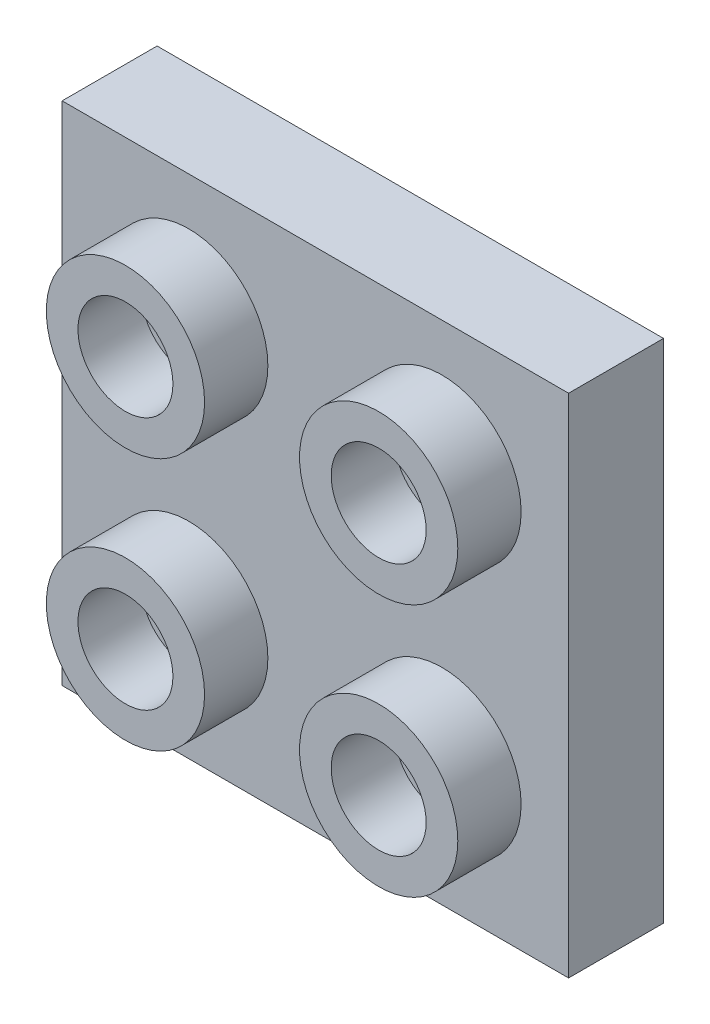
ISO-10303-21;
HEADER;
FILE_DESCRIPTION(('STEP AP214'),'2;1');
FILE_NAME('part.step','',(''),(''),'','','');
FILE_SCHEMA(('AUTOMOTIVE_DESIGN { 1 0 10303 214 1 1 1 1 }'));
ENDSEC;
DATA;
#1=APPLICATION_CONTEXT('core data for automotive mechanical design processes');
#2=APPLICATION_PROTOCOL_DEFINITION('international standard','automotive_design',2000,#1);
#3=PRODUCT_CONTEXT('',#1,'mechanical');
#4=PRODUCT('Part','Part','',(#3));
#5=PRODUCT_RELATED_PRODUCT_CATEGORY('part','',(#4));
#6=PRODUCT_DEFINITION_FORMATION('','',#4);
#7=PRODUCT_DEFINITION_CONTEXT('part definition',#1,'design');
#8=PRODUCT_DEFINITION('design','',#6,#7);
#9=PRODUCT_DEFINITION_SHAPE('','',#8);
#10=(LENGTH_UNIT() NAMED_UNIT(*) SI_UNIT(.MILLI.,.METRE.));
#11=(NAMED_UNIT(*) PLANE_ANGLE_UNIT() SI_UNIT($,.RADIAN.));
#12=(NAMED_UNIT(*) SI_UNIT($,.STERADIAN.) SOLID_ANGLE_UNIT());
#13=UNCERTAINTY_MEASURE_WITH_UNIT(LENGTH_MEASURE(1.E-05),#10,'distance_accuracy_value','');
#14=(GEOMETRIC_REPRESENTATION_CONTEXT(3) GLOBAL_UNCERTAINTY_ASSIGNED_CONTEXT((#13)) GLOBAL_UNIT_ASSIGNED_CONTEXT((#10,
#11,#12)) REPRESENTATION_CONTEXT('',''));
#15=CARTESIAN_POINT('',(0.,0.,0.));
#16=DIRECTION('',(0.,0.,1.));
#17=DIRECTION('',(1.,0.,0.));
#18=AXIS2_PLACEMENT_3D('',#15,#16,#17);
#19=CARTESIAN_POINT('',(-0.577603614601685,-1.13171549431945,-3.5));
#20=DIRECTION('',(0.,-1.,0.));
#21=DIRECTION('',(0.,0.,-1.));
#22=AXIS2_PLACEMENT_3D('',#19,#20,#21);
#23=CYLINDRICAL_SURFACE('',#22,2.45);
#24=CARTESIAN_POINT('',(-0.577603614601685,-1.13171549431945,-3.5));
#25=DIRECTION('',(0.,-1.,0.));
#26=DIRECTION('',(0.,0.,-1.));
#27=AXIS2_PLACEMENT_3D('',#24,#25,#26);
#28=CIRCLE('',#27,2.45);
#29=CARTESIAN_POINT('',(-0.577603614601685,-1.13171549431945,-5.95));
#30=VERTEX_POINT('',#29);
#31=EDGE_CURVE('E162',#30,#30,#28,.T.);
#32=ORIENTED_EDGE('',*,*,#31,.F.);
#33=EDGE_LOOP('',(#32));
#34=FACE_BOUND('',#33,.T.);
#35=CARTESIAN_POINT('',(-0.577603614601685,-7.33171549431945,-3.5));
#36=DIRECTION('',(0.,-1.,0.));
#37=DIRECTION('',(0.,0.,-1.));
#38=AXIS2_PLACEMENT_3D('',#35,#36,#37);
#39=CIRCLE('',#38,2.45);
#40=CARTESIAN_POINT('',(-0.577603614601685,-7.33171549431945,-5.95));
#41=VERTEX_POINT('',#40);
#42=EDGE_CURVE('E39',#41,#41,#39,.F.);
#43=ORIENTED_EDGE('',*,*,#42,.F.);
#44=EDGE_LOOP('',(#43));
#45=FACE_BOUND('',#44,.T.);
#46=ADVANCED_FACE('F35',(#34,#45),#23,.F.);
#47=CARTESIAN_POINT('',(-7.07760361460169,-6.63171549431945,-1.));
#48=DIRECTION('',(0.,-1.,0.));
#49=DIRECTION('',(1.,0.,0.));
#50=AXIS2_PLACEMENT_3D('',#47,#48,#49);
#51=PLANE('',#50);
#52=DIRECTION('',(-1.,0.,0.));
#53=VECTOR('',#52,1.);
#54=CARTESIAN_POINT('',(-7.07760361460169,-6.63171549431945,-1.));
#55=LINE('',#54,#53);
#56=CARTESIAN_POINT('',(-4.57760361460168,-6.63171549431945,-1.));
#57=VERTEX_POINT('',#56);
#58=CARTESIAN_POINT('',(-7.07760361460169,-6.63171549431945,-1.));
#59=VERTEX_POINT('',#58);
#60=EDGE_CURVE('E192',#57,#59,#55,.T.);
#61=ORIENTED_EDGE('',*,*,#60,.F.);
#62=DIRECTION('',(0.,0.,-1.));
#63=VECTOR('',#62,1.);
#64=CARTESIAN_POINT('',(-4.57760361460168,-6.63171549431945,-1.));
#65=LINE('',#64,#63);
#66=CARTESIAN_POINT('',(-4.57760361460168,-6.63171549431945,-3.));
#67=VERTEX_POINT('',#66);
#68=EDGE_CURVE('E176',#57,#67,#65,.T.);
#69=ORIENTED_EDGE('',*,*,#68,.T.);
#70=DIRECTION('',(-1.,0.,0.));
#71=VECTOR('',#70,1.);
#72=CARTESIAN_POINT('',(-7.07760361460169,-6.63171549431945,-3.));
#73=LINE('',#72,#71);
#74=CARTESIAN_POINT('',(-7.07760361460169,-6.63171549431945,-3.));
#75=VERTEX_POINT('',#74);
#76=EDGE_CURVE('E204',#67,#75,#73,.T.);
#77=ORIENTED_EDGE('',*,*,#76,.T.);
#78=DIRECTION('',(0.,0.,-1.));
#79=VECTOR('',#78,1.);
#80=CARTESIAN_POINT('',(-7.07760361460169,-6.63171549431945,-1.));
#81=LINE('',#80,#79);
#82=EDGE_CURVE('E207',#59,#75,#81,.T.);
#83=ORIENTED_EDGE('',*,*,#82,.F.);
#84=EDGE_LOOP('',(#61,#69,#77,#83));
#85=FACE_BOUND('',#84,.T.);
#86=ADVANCED_FACE('F299',(#85),#51,.F.);
#87=CARTESIAN_POINT('',(-8.57760361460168,-8.13171549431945,0.));
#88=DIRECTION('',(0.,0.,1.));
#89=DIRECTION('',(1.,0.,0.));
#90=AXIS2_PLACEMENT_3D('',#87,#88,#89);
#91=PLANE('',#90);
#92=CARTESIAN_POINT('',(-4.57760361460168,-4.13171549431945,0.));
#93=DIRECTION('',(0.,0.,1.));
#94=DIRECTION('',(1.,0.,0.));
#95=AXIS2_PLACEMENT_3D('',#92,#93,#94);
#96=CIRCLE('',#95,2.5);
#97=CARTESIAN_POINT('',(-2.07760361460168,-4.13171549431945,0.));
#98=VERTEX_POINT('',#97);
#99=EDGE_CURVE('E220',#98,#98,#96,.T.);
#100=ORIENTED_EDGE('',*,*,#99,.F.);
#101=EDGE_LOOP('',(#100));
#102=FACE_BOUND('',#101,.T.);
#103=DIRECTION('',(1.,0.,0.));
#104=VECTOR('',#103,1.);
#105=CARTESIAN_POINT('',(-8.57760361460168,-8.13171549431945,0.));
#106=LINE('',#105,#104);
#107=CARTESIAN_POINT('',(-8.57760361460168,-8.13171549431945,0.));
#108=VERTEX_POINT('',#107);
#109=CARTESIAN_POINT('',(7.42239638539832,-8.13171549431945,0.));
#110=VERTEX_POINT('',#109);
#111=EDGE_CURVE('E244',#108,#110,#106,.T.);
#112=ORIENTED_EDGE('',*,*,#111,.T.);
#113=DIRECTION('',(0.,1.,0.));
#114=VECTOR('',#113,1.);
#115=CARTESIAN_POINT('',(7.42239638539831,7.86828450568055,0.));
#116=LINE('',#115,#114);
#117=CARTESIAN_POINT('',(7.42239638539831,7.86828450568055,0.));
#118=VERTEX_POINT('',#117);
#119=EDGE_CURVE('E246',#110,#118,#116,.T.);
#120=ORIENTED_EDGE('',*,*,#119,.T.);
#121=DIRECTION('',(-1.,0.,0.));
#122=VECTOR('',#121,1.);
#123=CARTESIAN_POINT('',(-8.57760361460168,7.86828450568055,0.));
#124=LINE('',#123,#122);
#125=CARTESIAN_POINT('',(-8.57760361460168,7.86828450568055,0.));
#126=VERTEX_POINT('',#125);
#127=EDGE_CURVE('E231',#118,#126,#124,.T.);
#128=ORIENTED_EDGE('',*,*,#127,.T.);
#129=DIRECTION('',(0.,-1.,0.));
#130=VECTOR('',#129,1.);
#131=CARTESIAN_POINT('',(-8.57760361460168,7.86828450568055,0.));
#132=LINE('',#131,#130);
#133=EDGE_CURVE('E224',#126,#108,#132,.T.);
#134=ORIENTED_EDGE('',*,*,#133,.T.);
#135=EDGE_LOOP('',(#112,#120,#128,#134));
#136=FACE_BOUND('',#135,.T.);
#137=CARTESIAN_POINT('',(3.42239638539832,-4.13171549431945,0.));
#138=DIRECTION('',(0.,0.,1.));
#139=DIRECTION('',(1.,0.,0.));
#140=AXIS2_PLACEMENT_3D('',#137,#138,#139);
#141=CIRCLE('',#140,2.5);
#142=CARTESIAN_POINT('',(5.92239638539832,-4.13171549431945,0.));
#143=VERTEX_POINT('',#142);
#144=EDGE_CURVE('E209',#143,#143,#141,.T.);
#145=ORIENTED_EDGE('',*,*,#144,.F.);
#146=EDGE_LOOP('',(#145));
#147=FACE_BOUND('',#146,.T.);
#148=CARTESIAN_POINT('',(-4.57760361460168,3.86828450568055,0.));
#149=DIRECTION('',(0.,0.,1.));
#150=DIRECTION('',(1.,0.,0.));
#151=AXIS2_PLACEMENT_3D('',#148,#149,#150);
#152=CIRCLE('',#151,2.5);
#153=CARTESIAN_POINT('',(-2.07760361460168,3.86828450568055,0.));
#154=VERTEX_POINT('',#153);
#155=EDGE_CURVE('E253',#154,#154,#152,.T.);
#156=ORIENTED_EDGE('',*,*,#155,.F.);
#157=EDGE_LOOP('',(#156));
#158=FACE_BOUND('',#157,.T.);
#159=CARTESIAN_POINT('',(3.42239638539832,3.86828450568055,0.));
#160=DIRECTION('',(0.,0.,1.));
#161=DIRECTION('',(1.,0.,0.));
#162=AXIS2_PLACEMENT_3D('',#159,#160,#161);
#163=CIRCLE('',#162,2.5);
#164=CARTESIAN_POINT('',(5.92239638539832,3.86828450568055,0.));
#165=VERTEX_POINT('',#164);
#166=EDGE_CURVE('E265',#165,#165,#163,.T.);
#167=ORIENTED_EDGE('',*,*,#166,.F.);
#168=EDGE_LOOP('',(#167));
#169=FACE_BOUND('',#168,.T.);
#170=ADVANCED_FACE('F317',(#102,#136,#147,#158,#169),#91,.T.);
#171=CARTESIAN_POINT('',(-8.57760361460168,7.86828450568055,-3.));
#172=DIRECTION('',(-1.,0.,0.));
#173=DIRECTION('',(0.,0.,1.));
#174=AXIS2_PLACEMENT_3D('',#171,#172,#173);
#175=PLANE('',#174);
#176=ORIENTED_EDGE('',*,*,#133,.F.);
#177=DIRECTION('',(0.,0.,1.));
#178=VECTOR('',#177,1.);
#179=CARTESIAN_POINT('',(-8.57760361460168,7.86828450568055,-3.));
#180=LINE('',#179,#178);
#181=CARTESIAN_POINT('',(-8.57760361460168,7.86828450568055,-3.));
#182=VERTEX_POINT('',#181);
#183=EDGE_CURVE('E251',#182,#126,#180,.T.);
#184=ORIENTED_EDGE('',*,*,#183,.F.);
#185=DIRECTION('',(0.,-1.,0.));
#186=VECTOR('',#185,1.);
#187=CARTESIAN_POINT('',(-8.57760361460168,7.86828450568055,-3.));
#188=LINE('',#187,#186);
#189=CARTESIAN_POINT('',(-8.57760361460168,-8.13171549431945,-3.));
#190=VERTEX_POINT('',#189);
#191=EDGE_CURVE('E227',#182,#190,#188,.T.);
#192=ORIENTED_EDGE('',*,*,#191,.T.);
#193=DIRECTION('',(0.,0.,1.));
#194=VECTOR('',#193,1.);
#195=CARTESIAN_POINT('',(-8.57760361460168,-8.13171549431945,-3.));
#196=LINE('',#195,#194);
#197=EDGE_CURVE('E241',#190,#108,#196,.T.);
#198=ORIENTED_EDGE('',*,*,#197,.T.);
#199=EDGE_LOOP('',(#176,#184,#192,#198));
#200=FACE_BOUND('',#199,.T.);
#201=ADVANCED_FACE('F308',(#200),#175,.T.);
#202=CARTESIAN_POINT('',(-8.57760361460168,7.86828450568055,-3.));
#203=DIRECTION('',(0.,1.,0.));
#204=DIRECTION('',(0.,0.,1.));
#205=AXIS2_PLACEMENT_3D('',#202,#203,#204);
#206=PLANE('',#205);
#207=ORIENTED_EDGE('',*,*,#127,.F.);
#208=DIRECTION('',(0.,0.,1.));
#209=VECTOR('',#208,1.);
#210=CARTESIAN_POINT('',(7.42239638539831,7.86828450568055,-3.));
#211=LINE('',#210,#209);
#212=CARTESIAN_POINT('',(7.42239638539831,7.86828450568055,-3.));
#213=VERTEX_POINT('',#212);
#214=EDGE_CURVE('E254',#213,#118,#211,.T.);
#215=ORIENTED_EDGE('',*,*,#214,.F.);
#216=DIRECTION('',(-1.,0.,0.));
#217=VECTOR('',#216,1.);
#218=CARTESIAN_POINT('',(-8.57760361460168,7.86828450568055,-3.));
#219=LINE('',#218,#217);
#220=EDGE_CURVE('E238',#213,#182,#219,.T.);
#221=ORIENTED_EDGE('',*,*,#220,.T.);
#222=ORIENTED_EDGE('',*,*,#183,.T.);
#223=EDGE_LOOP('',(#207,#215,#221,#222));
#224=FACE_BOUND('',#223,.T.);
#225=ADVANCED_FACE('F312',(#224),#206,.T.);
#226=CARTESIAN_POINT('',(7.42239638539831,7.86828450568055,-3.));
#227=DIRECTION('',(1.,0.,0.));
#228=DIRECTION('',(0.,1.,0.));
#229=AXIS2_PLACEMENT_3D('',#226,#227,#228);
#230=PLANE('',#229);
#231=ORIENTED_EDGE('',*,*,#119,.F.);
#232=DIRECTION('',(0.,0.,1.));
#233=VECTOR('',#232,1.);
#234=CARTESIAN_POINT('',(7.42239638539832,-8.13171549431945,-3.));
#235=LINE('',#234,#233);
#236=CARTESIAN_POINT('',(7.42239638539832,-8.13171549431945,-3.));
#237=VERTEX_POINT('',#236);
#238=EDGE_CURVE('E256',#237,#110,#235,.T.);
#239=ORIENTED_EDGE('',*,*,#238,.F.);
#240=DIRECTION('',(0.,1.,0.));
#241=VECTOR('',#240,1.);
#242=CARTESIAN_POINT('',(7.42239638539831,7.86828450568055,-3.));
#243=LINE('',#242,#241);
#244=EDGE_CURVE('E235',#237,#213,#243,.T.);
#245=ORIENTED_EDGE('',*,*,#244,.T.);
#246=ORIENTED_EDGE('',*,*,#214,.T.);
#247=EDGE_LOOP('',(#231,#239,#245,#246));
#248=FACE_BOUND('',#247,.T.);
#249=ADVANCED_FACE('F315',(#248),#230,.T.);
#250=CARTESIAN_POINT('',(-8.57760361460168,-8.13171549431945,-3.));
#251=DIRECTION('',(0.,-1.,0.));
#252=DIRECTION('',(0.,0.,-1.));
#253=AXIS2_PLACEMENT_3D('',#250,#251,#252);
#254=PLANE('',#253);
#255=CARTESIAN_POINT('',(-0.577603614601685,-8.13171549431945,-3.5));
#256=DIRECTION('',(0.,-1.,0.));
#257=DIRECTION('',(0.,0.,-1.));
#258=AXIS2_PLACEMENT_3D('',#255,#256,#257);
#259=CIRCLE('',#258,3.);
#260=CARTESIAN_POINT('',(-0.577603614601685,-8.13171549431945,-6.5));
#261=VERTEX_POINT('',#260);
#262=EDGE_CURVE('E431',#261,#261,#259,.T.);
#263=ORIENTED_EDGE('',*,*,#262,.F.);
#264=EDGE_LOOP('',(#263));
#265=FACE_BOUND('',#264,.T.);
#266=ORIENTED_EDGE('',*,*,#238,.T.);
#267=ORIENTED_EDGE('',*,*,#111,.F.);
#268=ORIENTED_EDGE('',*,*,#197,.F.);
#269=DIRECTION('',(1.,0.,0.));
#270=VECTOR('',#269,1.);
#271=CARTESIAN_POINT('',(-8.57760361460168,-8.13171549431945,-3.));
#272=LINE('',#271,#270);
#273=CARTESIAN_POINT('',(-4.57760361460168,-8.13171549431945,-3.));
#274=VERTEX_POINT('',#273);
#275=EDGE_CURVE('E232',#190,#274,#272,.T.);
#276=ORIENTED_EDGE('',*,*,#275,.T.);
#277=DIRECTION('',(0.,0.,-1.));
#278=VECTOR('',#277,1.);
#279=CARTESIAN_POINT('',(-4.57760361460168,-8.13171549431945,-3.5));
#280=LINE('',#279,#278);
#281=CARTESIAN_POINT('',(-4.57760361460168,-8.13171549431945,-3.5));
#282=VERTEX_POINT('',#281);
#283=EDGE_CURVE('E158',#274,#282,#280,.T.);
#284=ORIENTED_EDGE('',*,*,#283,.T.);
#285=CARTESIAN_POINT('',(-0.577603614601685,-8.13171549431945,-3.5));
#286=DIRECTION('',(0.,-1.,0.));
#287=DIRECTION('',(0.,0.,-1.));
#288=AXIS2_PLACEMENT_3D('',#285,#286,#287);
#289=CIRCLE('',#288,4.);
#290=CARTESIAN_POINT('',(3.42239638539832,-8.13171549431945,-3.5));
#291=VERTEX_POINT('',#290);
#292=EDGE_CURVE('E166',#282,#291,#289,.T.);
#293=ORIENTED_EDGE('',*,*,#292,.T.);
#294=DIRECTION('',(0.,0.,1.));
#295=VECTOR('',#294,1.);
#296=CARTESIAN_POINT('',(3.42239638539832,-8.13171549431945,-3.5));
#297=LINE('',#296,#295);
#298=CARTESIAN_POINT('',(3.42239638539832,-8.13171549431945,-3.));
#299=VERTEX_POINT('',#298);
#300=EDGE_CURVE('E143',#291,#299,#297,.T.);
#301=ORIENTED_EDGE('',*,*,#300,.T.);
#302=EDGE_CURVE('E230',#299,#237,#272,.T.);
#303=ORIENTED_EDGE('',*,*,#302,.T.);
#304=EDGE_LOOP('',(#266,#267,#268,#276,#284,#293,#301,#303));
#305=FACE_BOUND('',#304,.T.);
#306=ADVANCED_FACE('F291',(#265,#305),#254,.T.);
#307=CARTESIAN_POINT('',(-8.57760361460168,-8.13171549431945,-3.));
#308=DIRECTION('',(0.,0.,1.));
#309=DIRECTION('',(1.,0.,0.));
#310=AXIS2_PLACEMENT_3D('',#307,#308,#309);
#311=PLANE('',#310);
#312=ORIENTED_EDGE('',*,*,#76,.F.);
#313=DIRECTION('',(0.,-1.,0.));
#314=VECTOR('',#313,1.);
#315=CARTESIAN_POINT('',(-4.57760361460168,-8.13171549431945,-3.));
#316=LINE('',#315,#314);
#317=EDGE_CURVE('E179',#67,#274,#316,.T.);
#318=ORIENTED_EDGE('',*,*,#317,.T.);
#319=ORIENTED_EDGE('',*,*,#275,.F.);
#320=ORIENTED_EDGE('',*,*,#191,.F.);
#321=ORIENTED_EDGE('',*,*,#220,.F.);
#322=ORIENTED_EDGE('',*,*,#244,.F.);
#323=ORIENTED_EDGE('',*,*,#302,.F.);
#324=DIRECTION('',(0.,1.,0.));
#325=VECTOR('',#324,1.);
#326=CARTESIAN_POINT('',(3.42239638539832,-8.13171549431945,-3.));
#327=LINE('',#326,#325);
#328=CARTESIAN_POINT('',(3.42239638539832,-6.63171549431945,-3.));
#329=VERTEX_POINT('',#328);
#330=EDGE_CURVE('E173',#299,#329,#327,.T.);
#331=ORIENTED_EDGE('',*,*,#330,.T.);
#332=CARTESIAN_POINT('',(5.92239638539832,-6.63171549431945,-3.));
#333=VERTEX_POINT('',#332);
#334=EDGE_CURVE('E186',#333,#329,#73,.T.);
#335=ORIENTED_EDGE('',*,*,#334,.F.);
#336=DIRECTION('',(0.,-1.,0.));
#337=VECTOR('',#336,1.);
#338=CARTESIAN_POINT('',(5.92239638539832,-6.63171549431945,-3.));
#339=LINE('',#338,#337);
#340=CARTESIAN_POINT('',(5.92239638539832,6.36828450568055,-3.));
#341=VERTEX_POINT('',#340);
#342=EDGE_CURVE('E201',#341,#333,#339,.T.);
#343=ORIENTED_EDGE('',*,*,#342,.F.);
#344=DIRECTION('',(1.,0.,0.));
#345=VECTOR('',#344,1.);
#346=CARTESIAN_POINT('',(-7.07760361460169,6.36828450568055,-3.));
#347=LINE('',#346,#345);
#348=CARTESIAN_POINT('',(-7.07760361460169,6.36828450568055,-3.));
#349=VERTEX_POINT('',#348);
#350=EDGE_CURVE('E198',#349,#341,#347,.T.);
#351=ORIENTED_EDGE('',*,*,#350,.F.);
#352=DIRECTION('',(0.,1.,0.));
#353=VECTOR('',#352,1.);
#354=CARTESIAN_POINT('',(-7.07760361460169,-6.63171549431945,-3.));
#355=LINE('',#354,#353);
#356=EDGE_CURVE('E58',#75,#349,#355,.T.);
#357=ORIENTED_EDGE('',*,*,#356,.F.);
#358=EDGE_LOOP('',(#312,#318,#319,#320,#321,#322,#323,#331,#335,#343,#351,#357));
#359=FACE_BOUND('',#358,.T.);
#360=ADVANCED_FACE('F287',(#359),#311,.F.);
#361=CARTESIAN_POINT('',(-4.57760361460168,-4.13171549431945,2.));
#362=DIRECTION('',(0.,0.,-1.));
#363=DIRECTION('',(-1.,0.,0.));
#364=AXIS2_PLACEMENT_3D('',#361,#362,#363);
#365=CYLINDRICAL_SURFACE('',#364,2.5);
#366=CARTESIAN_POINT('',(-4.57760361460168,-4.13171549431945,2.));
#367=DIRECTION('',(0.,0.,1.));
#368=DIRECTION('',(1.,0.,0.));
#369=AXIS2_PLACEMENT_3D('',#366,#367,#368);
#370=CIRCLE('',#369,2.5);
#371=CARTESIAN_POINT('',(-2.07760361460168,-4.13171549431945,2.));
#372=VERTEX_POINT('',#371);
#373=EDGE_CURVE('E221',#372,#372,#370,.T.);
#374=ORIENTED_EDGE('',*,*,#373,.F.);
#375=EDGE_LOOP('',(#374));
#376=FACE_BOUND('',#375,.T.);
#377=ORIENTED_EDGE('',*,*,#99,.T.);
#378=EDGE_LOOP('',(#377));
#379=FACE_BOUND('',#378,.T.);
#380=ADVANCED_FACE('F382',(#376,#379),#365,.T.);
#381=CARTESIAN_POINT('',(-4.57760361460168,-4.13171549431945,2.));
#382=DIRECTION('',(0.,0.,1.));
#383=DIRECTION('',(1.,0.,0.));
#384=AXIS2_PLACEMENT_3D('',#381,#382,#383);
#385=PLANE('',#384);
#386=CARTESIAN_POINT('',(-4.57760361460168,-4.13171549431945,2.));
#387=DIRECTION('',(0.,0.,1.));
#388=DIRECTION('',(1.,0.,0.));
#389=AXIS2_PLACEMENT_3D('',#386,#387,#388);
#390=CIRCLE('',#389,1.5);
#391=CARTESIAN_POINT('',(-3.07760361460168,-4.13171549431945,2.));
#392=VERTEX_POINT('',#391);
#393=EDGE_CURVE('E425',#392,#392,#390,.T.);
#394=ORIENTED_EDGE('',*,*,#393,.F.);
#395=EDGE_LOOP('',(#394));
#396=FACE_BOUND('',#395,.T.);
#397=ORIENTED_EDGE('',*,*,#373,.T.);
#398=EDGE_LOOP('',(#397));
#399=FACE_BOUND('',#398,.T.);
#400=ADVANCED_FACE('F376',(#396,#399),#385,.T.);
#401=CARTESIAN_POINT('',(3.42239638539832,-4.13171549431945,2.));
#402=DIRECTION('',(0.,0.,-1.));
#403=DIRECTION('',(-1.,0.,0.));
#404=AXIS2_PLACEMENT_3D('',#401,#402,#403);
#405=CYLINDRICAL_SURFACE('',#404,2.5);
#406=CARTESIAN_POINT('',(3.42239638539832,-4.13171549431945,2.));
#407=DIRECTION('',(0.,0.,1.));
#408=DIRECTION('',(1.,0.,0.));
#409=AXIS2_PLACEMENT_3D('',#406,#407,#408);
#410=CIRCLE('',#409,2.5);
#411=CARTESIAN_POINT('',(5.92239638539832,-4.13171549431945,2.));
#412=VERTEX_POINT('',#411);
#413=EDGE_CURVE('E217',#412,#412,#410,.T.);
#414=ORIENTED_EDGE('',*,*,#413,.F.);
#415=EDGE_LOOP('',(#414));
#416=FACE_BOUND('',#415,.T.);
#417=ORIENTED_EDGE('',*,*,#144,.T.);
#418=EDGE_LOOP('',(#417));
#419=FACE_BOUND('',#418,.T.);
#420=ADVANCED_FACE('F374',(#416,#419),#405,.T.);
#421=CARTESIAN_POINT('',(3.42239638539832,-4.13171549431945,2.));
#422=DIRECTION('',(0.,0.,1.));
#423=DIRECTION('',(1.,0.,0.));
#424=AXIS2_PLACEMENT_3D('',#421,#422,#423);
#425=PLANE('',#424);
#426=CARTESIAN_POINT('',(3.42239638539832,-4.13171549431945,2.));
#427=DIRECTION('',(0.,0.,1.));
#428=DIRECTION('',(1.,0.,0.));
#429=AXIS2_PLACEMENT_3D('',#426,#427,#428);
#430=CIRCLE('',#429,1.5);
#431=CARTESIAN_POINT('',(4.92239638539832,-4.13171549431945,2.));
#432=VERTEX_POINT('',#431);
#433=EDGE_CURVE('E415',#432,#432,#430,.T.);
#434=ORIENTED_EDGE('',*,*,#433,.F.);
#435=EDGE_LOOP('',(#434));
#436=FACE_BOUND('',#435,.T.);
#437=ORIENTED_EDGE('',*,*,#413,.T.);
#438=EDGE_LOOP('',(#437));
#439=FACE_BOUND('',#438,.T.);
#440=ADVANCED_FACE('F370',(#436,#439),#425,.T.);
#441=CARTESIAN_POINT('',(-4.57760361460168,3.86828450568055,2.));
#442=DIRECTION('',(0.,0.,1.));
#443=DIRECTION('',(1.,0.,0.));
#444=AXIS2_PLACEMENT_3D('',#441,#442,#443);
#445=PLANE('',#444);
#446=CARTESIAN_POINT('',(-4.57760361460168,3.86828450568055,2.));
#447=DIRECTION('',(0.,0.,1.));
#448=DIRECTION('',(1.,0.,0.));
#449=AXIS2_PLACEMENT_3D('',#446,#447,#448);
#450=CIRCLE('',#449,1.5);
#451=CARTESIAN_POINT('',(-3.07760361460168,3.86828450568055,2.));
#452=VERTEX_POINT('',#451);
#453=EDGE_CURVE('E407',#452,#452,#450,.T.);
#454=ORIENTED_EDGE('',*,*,#453,.F.);
#455=EDGE_LOOP('',(#454));
#456=FACE_BOUND('',#455,.T.);
#457=CARTESIAN_POINT('',(-4.57760361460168,3.86828450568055,2.));
#458=DIRECTION('',(0.,0.,1.));
#459=DIRECTION('',(1.,0.,0.));
#460=AXIS2_PLACEMENT_3D('',#457,#458,#459);
#461=CIRCLE('',#460,2.5);
#462=CARTESIAN_POINT('',(-2.07760361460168,3.86828450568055,2.));
#463=VERTEX_POINT('',#462);
#464=EDGE_CURVE('E262',#463,#463,#461,.T.);
#465=ORIENTED_EDGE('',*,*,#464,.T.);
#466=EDGE_LOOP('',(#465));
#467=FACE_BOUND('',#466,.T.);
#468=ADVANCED_FACE('F373',(#456,#467),#445,.T.);
#469=CARTESIAN_POINT('',(-4.57760361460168,3.86828450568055,2.));
#470=DIRECTION('',(0.,0.,-1.));
#471=DIRECTION('',(-1.,0.,0.));
#472=AXIS2_PLACEMENT_3D('',#469,#470,#471);
#473=CYLINDRICAL_SURFACE('',#472,2.5);
#474=ORIENTED_EDGE('',*,*,#464,.F.);
#475=EDGE_LOOP('',(#474));
#476=FACE_BOUND('',#475,.T.);
#477=ORIENTED_EDGE('',*,*,#155,.T.);
#478=EDGE_LOOP('',(#477));
#479=FACE_BOUND('',#478,.T.);
#480=ADVANCED_FACE('F336',(#476,#479),#473,.T.);
#481=CARTESIAN_POINT('',(3.42239638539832,3.86828450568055,2.));
#482=DIRECTION('',(0.,0.,1.));
#483=DIRECTION('',(1.,0.,0.));
#484=AXIS2_PLACEMENT_3D('',#481,#482,#483);
#485=PLANE('',#484);
#486=CARTESIAN_POINT('',(3.42239638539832,3.86828450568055,2.));
#487=DIRECTION('',(0.,0.,1.));
#488=DIRECTION('',(1.,0.,0.));
#489=AXIS2_PLACEMENT_3D('',#486,#487,#488);
#490=CIRCLE('',#489,1.5);
#491=CARTESIAN_POINT('',(4.92239638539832,3.86828450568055,2.));
#492=VERTEX_POINT('',#491);
#493=EDGE_CURVE('E418',#492,#492,#490,.T.);
#494=ORIENTED_EDGE('',*,*,#493,.F.);
#495=EDGE_LOOP('',(#494));
#496=FACE_BOUND('',#495,.T.);
#497=CARTESIAN_POINT('',(3.42239638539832,3.86828450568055,2.));
#498=DIRECTION('',(0.,0.,1.));
#499=DIRECTION('',(1.,0.,0.));
#500=AXIS2_PLACEMENT_3D('',#497,#498,#499);
#501=CIRCLE('',#500,2.5);
#502=CARTESIAN_POINT('',(5.92239638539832,3.86828450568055,2.));
#503=VERTEX_POINT('',#502);
#504=EDGE_CURVE('E268',#503,#503,#501,.T.);
#505=ORIENTED_EDGE('',*,*,#504,.T.);
#506=EDGE_LOOP('',(#505));
#507=FACE_BOUND('',#506,.T.);
#508=ADVANCED_FACE('F37',(#496,#507),#485,.T.);
#509=CARTESIAN_POINT('',(3.42239638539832,3.86828450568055,2.));
#510=DIRECTION('',(0.,0.,-1.));
#511=DIRECTION('',(-1.,0.,0.));
#512=AXIS2_PLACEMENT_3D('',#509,#510,#511);
#513=CYLINDRICAL_SURFACE('',#512,2.5);
#514=ORIENTED_EDGE('',*,*,#504,.F.);
#515=EDGE_LOOP('',(#514));
#516=FACE_BOUND('',#515,.T.);
#517=ORIENTED_EDGE('',*,*,#166,.T.);
#518=EDGE_LOOP('',(#517));
#519=FACE_BOUND('',#518,.T.);
#520=ADVANCED_FACE('F328',(#516,#519),#513,.T.);
#521=CARTESIAN_POINT('',(-7.07760361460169,-6.63171549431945,-1.));
#522=DIRECTION('',(-1.,0.,0.));
#523=DIRECTION('',(0.,0.,1.));
#524=AXIS2_PLACEMENT_3D('',#521,#522,#523);
#525=PLANE('',#524);
#526=ORIENTED_EDGE('',*,*,#356,.T.);
#527=DIRECTION('',(0.,0.,-1.));
#528=VECTOR('',#527,1.);
#529=CARTESIAN_POINT('',(-7.07760361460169,6.36828450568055,-1.));
#530=LINE('',#529,#528);
#531=CARTESIAN_POINT('',(-7.07760361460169,6.36828450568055,-1.));
#532=VERTEX_POINT('',#531);
#533=EDGE_CURVE('E196',#532,#349,#530,.T.);
#534=ORIENTED_EDGE('',*,*,#533,.F.);
#535=DIRECTION('',(0.,1.,0.));
#536=VECTOR('',#535,1.);
#537=CARTESIAN_POINT('',(-7.07760361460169,-6.63171549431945,-1.));
#538=LINE('',#537,#536);
#539=EDGE_CURVE('E182',#59,#532,#538,.T.);
#540=ORIENTED_EDGE('',*,*,#539,.F.);
#541=ORIENTED_EDGE('',*,*,#82,.T.);
#542=EDGE_LOOP('',(#526,#534,#540,#541));
#543=FACE_BOUND('',#542,.T.);
#544=ADVANCED_FACE('F301',(#543),#525,.F.);
#545=ORIENTED_EDGE('',*,*,#334,.T.);
#546=DIRECTION('',(0.,0.,1.));
#547=VECTOR('',#546,1.);
#548=CARTESIAN_POINT('',(3.42239638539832,-6.63171549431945,-1.));
#549=LINE('',#548,#547);
#550=CARTESIAN_POINT('',(3.42239638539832,-6.63171549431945,-1.));
#551=VERTEX_POINT('',#550);
#552=EDGE_CURVE('E169',#329,#551,#549,.T.);
#553=ORIENTED_EDGE('',*,*,#552,.T.);
#554=CARTESIAN_POINT('',(5.92239638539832,-6.63171549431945,-1.));
#555=VERTEX_POINT('',#554);
#556=EDGE_CURVE('E193',#555,#551,#55,.T.);
#557=ORIENTED_EDGE('',*,*,#556,.F.);
#558=DIRECTION('',(0.,0.,-1.));
#559=VECTOR('',#558,1.);
#560=CARTESIAN_POINT('',(5.92239638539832,-6.63171549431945,-1.));
#561=LINE('',#560,#559);
#562=EDGE_CURVE('E210',#555,#333,#561,.T.);
#563=ORIENTED_EDGE('',*,*,#562,.T.);
#564=EDGE_LOOP('',(#545,#553,#557,#563));
#565=FACE_BOUND('',#564,.T.);
#566=ADVANCED_FACE('F275',(#565),#51,.F.);
#567=CARTESIAN_POINT('',(5.92239638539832,-6.63171549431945,-1.));
#568=DIRECTION('',(1.,0.,0.));
#569=DIRECTION('',(0.,0.,-1.));
#570=AXIS2_PLACEMENT_3D('',#567,#568,#569);
#571=PLANE('',#570);
#572=ORIENTED_EDGE('',*,*,#342,.T.);
#573=ORIENTED_EDGE('',*,*,#562,.F.);
#574=DIRECTION('',(0.,-1.,0.));
#575=VECTOR('',#574,1.);
#576=CARTESIAN_POINT('',(5.92239638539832,-6.63171549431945,-1.));
#577=LINE('',#576,#575);
#578=CARTESIAN_POINT('',(5.92239638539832,6.36828450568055,-1.));
#579=VERTEX_POINT('',#578);
#580=EDGE_CURVE('E189',#579,#555,#577,.T.);
#581=ORIENTED_EDGE('',*,*,#580,.F.);
#582=DIRECTION('',(0.,0.,-1.));
#583=VECTOR('',#582,1.);
#584=CARTESIAN_POINT('',(5.92239638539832,6.36828450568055,-1.));
#585=LINE('',#584,#583);
#586=EDGE_CURVE('E212',#579,#341,#585,.T.);
#587=ORIENTED_EDGE('',*,*,#586,.T.);
#588=EDGE_LOOP('',(#572,#573,#581,#587));
#589=FACE_BOUND('',#588,.T.);
#590=ADVANCED_FACE('F282',(#589),#571,.F.);
#591=CARTESIAN_POINT('',(-7.07760361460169,6.36828450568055,-1.));
#592=DIRECTION('',(0.,1.,0.));
#593=DIRECTION('',(-1.,0.,0.));
#594=AXIS2_PLACEMENT_3D('',#591,#592,#593);
#595=PLANE('',#594);
#596=ORIENTED_EDGE('',*,*,#350,.T.);
#597=ORIENTED_EDGE('',*,*,#586,.F.);
#598=DIRECTION('',(1.,0.,0.));
#599=VECTOR('',#598,1.);
#600=CARTESIAN_POINT('',(-7.07760361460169,6.36828450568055,-1.));
#601=LINE('',#600,#599);
#602=EDGE_CURVE('E185',#532,#579,#601,.T.);
#603=ORIENTED_EDGE('',*,*,#602,.F.);
#604=ORIENTED_EDGE('',*,*,#533,.T.);
#605=EDGE_LOOP('',(#596,#597,#603,#604));
#606=FACE_BOUND('',#605,.T.);
#607=ADVANCED_FACE('F303',(#606),#595,.F.);
#608=CARTESIAN_POINT('',(-7.07760361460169,6.36828450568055,-1.));
#609=DIRECTION('',(0.,0.,-1.));
#610=DIRECTION('',(-1.,0.,0.));
#611=AXIS2_PLACEMENT_3D('',#608,#609,#610);
#612=PLANE('',#611);
#613=DIRECTION('',(0.,1.,0.));
#614=VECTOR('',#613,1.);
#615=CARTESIAN_POINT('',(-4.57760361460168,6.36828450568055,-1.));
#616=LINE('',#615,#614);
#617=CARTESIAN_POINT('',(-4.57760361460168,-1.13171549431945,-1.));
#618=VERTEX_POINT('',#617);
#619=EDGE_CURVE('E11',#57,#618,#616,.T.);
#620=ORIENTED_EDGE('',*,*,#619,.F.);
#621=ORIENTED_EDGE('',*,*,#60,.T.);
#622=ORIENTED_EDGE('',*,*,#539,.T.);
#623=ORIENTED_EDGE('',*,*,#602,.T.);
#624=ORIENTED_EDGE('',*,*,#580,.T.);
#625=ORIENTED_EDGE('',*,*,#556,.T.);
#626=DIRECTION('',(0.,-1.,0.));
#627=VECTOR('',#626,1.);
#628=CARTESIAN_POINT('',(3.42239638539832,6.36828450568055,-1.));
#629=LINE('',#628,#627);
#630=CARTESIAN_POINT('',(3.42239638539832,-1.13171549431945,-1.));
#631=VERTEX_POINT('',#630);
#632=EDGE_CURVE('E44',#631,#551,#629,.T.);
#633=ORIENTED_EDGE('',*,*,#632,.F.);
#634=DIRECTION('',(-1.,0.,0.));
#635=VECTOR('',#634,1.);
#636=CARTESIAN_POINT('',(-7.07760361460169,-1.13171549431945,-1.));
#637=LINE('',#636,#635);
#638=EDGE_CURVE('E153',#631,#618,#637,.T.);
#639=ORIENTED_EDGE('',*,*,#638,.T.);
#640=EDGE_LOOP('',(#620,#621,#622,#623,#624,#625,#633,#639));
#641=FACE_BOUND('',#640,.T.);
#642=ADVANCED_FACE('F278',(#641),#612,.T.);
#643=CARTESIAN_POINT('',(-4.57760361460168,-1.13171549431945,-3.5));
#644=DIRECTION('',(-1.,0.,0.));
#645=DIRECTION('',(0.,0.,1.));
#646=AXIS2_PLACEMENT_3D('',#643,#644,#645);
#647=PLANE('',#646);
#648=ORIENTED_EDGE('',*,*,#317,.F.);
#649=ORIENTED_EDGE('',*,*,#68,.F.);
#650=ORIENTED_EDGE('',*,*,#619,.T.);
#651=DIRECTION('',(0.,0.,-1.));
#652=VECTOR('',#651,1.);
#653=CARTESIAN_POINT('',(-4.57760361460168,-1.13171549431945,-3.5));
#654=LINE('',#653,#652);
#655=CARTESIAN_POINT('',(-4.57760361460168,-1.13171549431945,-3.5));
#656=VERTEX_POINT('',#655);
#657=EDGE_CURVE('E51',#618,#656,#654,.T.);
#658=ORIENTED_EDGE('',*,*,#657,.T.);
#659=DIRECTION('',(0.,-1.,0.));
#660=VECTOR('',#659,1.);
#661=CARTESIAN_POINT('',(-4.57760361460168,-1.13171549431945,-3.5));
#662=LINE('',#661,#660);
#663=EDGE_CURVE('E148',#656,#282,#662,.T.);
#664=ORIENTED_EDGE('',*,*,#663,.T.);
#665=ORIENTED_EDGE('',*,*,#283,.F.);
#666=EDGE_LOOP('',(#648,#649,#650,#658,#664,#665));
#667=FACE_BOUND('',#666,.T.);
#668=ADVANCED_FACE('F295',(#667),#647,.T.);
#669=CARTESIAN_POINT('',(3.42239638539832,-1.13171549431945,-3.5));
#670=DIRECTION('',(1.,0.,0.));
#671=DIRECTION('',(0.,0.,-1.));
#672=AXIS2_PLACEMENT_3D('',#669,#670,#671);
#673=PLANE('',#672);
#674=ORIENTED_EDGE('',*,*,#330,.F.);
#675=ORIENTED_EDGE('',*,*,#300,.F.);
#676=DIRECTION('',(0.,-1.,0.));
#677=VECTOR('',#676,1.);
#678=CARTESIAN_POINT('',(3.42239638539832,-1.13171549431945,-3.5));
#679=LINE('',#678,#677);
#680=CARTESIAN_POINT('',(3.42239638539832,-1.13171549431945,-3.5));
#681=VERTEX_POINT('',#680);
#682=EDGE_CURVE('E137',#681,#291,#679,.T.);
#683=ORIENTED_EDGE('',*,*,#682,.F.);
#684=DIRECTION('',(0.,0.,1.));
#685=VECTOR('',#684,1.);
#686=CARTESIAN_POINT('',(3.42239638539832,-1.13171549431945,-3.5));
#687=LINE('',#686,#685);
#688=EDGE_CURVE('E140',#681,#631,#687,.T.);
#689=ORIENTED_EDGE('',*,*,#688,.T.);
#690=ORIENTED_EDGE('',*,*,#632,.T.);
#691=ORIENTED_EDGE('',*,*,#552,.F.);
#692=EDGE_LOOP('',(#674,#675,#683,#689,#690,#691));
#693=FACE_BOUND('',#692,.T.);
#694=ADVANCED_FACE('F139',(#693),#673,.T.);
#695=CARTESIAN_POINT('',(-0.577603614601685,-1.13171549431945,-3.5));
#696=DIRECTION('',(0.,-1.,0.));
#697=DIRECTION('',(0.,0.,-1.));
#698=AXIS2_PLACEMENT_3D('',#695,#696,#697);
#699=CYLINDRICAL_SURFACE('',#698,4.);
#700=ORIENTED_EDGE('',*,*,#292,.F.);
#701=ORIENTED_EDGE('',*,*,#663,.F.);
#702=CARTESIAN_POINT('',(-0.577603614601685,-1.13171549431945,-3.5));
#703=DIRECTION('',(0.,-1.,0.));
#704=DIRECTION('',(0.,0.,-1.));
#705=AXIS2_PLACEMENT_3D('',#702,#703,#704);
#706=CIRCLE('',#705,4.);
#707=EDGE_CURVE('E151',#656,#681,#706,.T.);
#708=ORIENTED_EDGE('',*,*,#707,.T.);
#709=ORIENTED_EDGE('',*,*,#682,.T.);
#710=EDGE_LOOP('',(#700,#701,#708,#709));
#711=FACE_BOUND('',#710,.T.);
#712=ADVANCED_FACE('F156',(#711),#699,.T.);
#713=CARTESIAN_POINT('',(-0.577603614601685,-1.13171549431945,-3.5));
#714=DIRECTION('',(0.,-1.,0.));
#715=DIRECTION('',(0.,0.,-1.));
#716=AXIS2_PLACEMENT_3D('',#713,#714,#715);
#717=PLANE('',#716);
#718=ORIENTED_EDGE('',*,*,#31,.T.);
#719=EDGE_LOOP('',(#718));
#720=FACE_BOUND('',#719,.T.);
#721=ORIENTED_EDGE('',*,*,#638,.F.);
#722=ORIENTED_EDGE('',*,*,#688,.F.);
#723=ORIENTED_EDGE('',*,*,#707,.F.);
#724=ORIENTED_EDGE('',*,*,#657,.F.);
#725=EDGE_LOOP('',(#721,#722,#723,#724));
#726=FACE_BOUND('',#725,.T.);
#727=ADVANCED_FACE('F150',(#720,#726),#717,.F.);
#728=CARTESIAN_POINT('',(-0.577603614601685,-7.33171549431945,-3.5));
#729=DIRECTION('',(0.,-1.,0.));
#730=DIRECTION('',(0.,0.,-1.));
#731=AXIS2_PLACEMENT_3D('',#728,#729,#730);
#732=PLANE('',#731);
#733=CARTESIAN_POINT('',(-0.577603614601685,-7.33171549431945,-3.5));
#734=DIRECTION('',(0.,-1.,0.));
#735=DIRECTION('',(0.,0.,-1.));
#736=AXIS2_PLACEMENT_3D('',#733,#734,#735);
#737=CIRCLE('',#736,3.);
#738=CARTESIAN_POINT('',(-0.577603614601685,-7.33171549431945,-6.5));
#739=VERTEX_POINT('',#738);
#740=EDGE_CURVE('E434',#739,#739,#737,.T.);
#741=ORIENTED_EDGE('',*,*,#740,.T.);
#742=EDGE_LOOP('',(#741));
#743=FACE_BOUND('',#742,.T.);
#744=ORIENTED_EDGE('',*,*,#42,.T.);
#745=EDGE_LOOP('',(#744));
#746=FACE_BOUND('',#745,.T.);
#747=ADVANCED_FACE('F355',(#743,#746),#732,.T.);
#748=CARTESIAN_POINT('',(-0.577603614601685,-7.33171549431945,-3.5));
#749=DIRECTION('',(0.,-1.,0.));
#750=DIRECTION('',(0.,0.,-1.));
#751=AXIS2_PLACEMENT_3D('',#748,#749,#750);
#752=CYLINDRICAL_SURFACE('',#751,3.);
#753=ORIENTED_EDGE('',*,*,#740,.F.);
#754=EDGE_LOOP('',(#753));
#755=FACE_BOUND('',#754,.T.);
#756=ORIENTED_EDGE('',*,*,#262,.T.);
#757=EDGE_LOOP('',(#756));
#758=FACE_BOUND('',#757,.T.);
#759=ADVANCED_FACE('F351',(#755,#758),#752,.F.);
#760=CARTESIAN_POINT('',(-4.57760361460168,-4.13171549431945,0.));
#761=DIRECTION('',(0.,0.,1.));
#762=DIRECTION('',(1.,0.,0.));
#763=AXIS2_PLACEMENT_3D('',#760,#761,#762);
#764=CYLINDRICAL_SURFACE('',#763,1.5);
#765=CARTESIAN_POINT('',(-4.57760361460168,-4.13171549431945,0.));
#766=DIRECTION('',(0.,0.,1.));
#767=DIRECTION('',(1.,0.,0.));
#768=AXIS2_PLACEMENT_3D('',#765,#766,#767);
#769=CIRCLE('',#768,1.5);
#770=CARTESIAN_POINT('',(-3.07760361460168,-4.13171549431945,0.));
#771=VERTEX_POINT('',#770);
#772=EDGE_CURVE('E428',#771,#771,#769,.T.);
#773=ORIENTED_EDGE('',*,*,#772,.F.);
#774=EDGE_LOOP('',(#773));
#775=FACE_BOUND('',#774,.T.);
#776=ORIENTED_EDGE('',*,*,#393,.T.);
#777=EDGE_LOOP('',(#776));
#778=FACE_BOUND('',#777,.T.);
#779=ADVANCED_FACE('F440',(#775,#778),#764,.F.);
#780=CARTESIAN_POINT('',(-4.57760361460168,-4.13171549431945,0.));
#781=DIRECTION('',(0.,0.,1.));
#782=DIRECTION('',(1.,0.,0.));
#783=AXIS2_PLACEMENT_3D('',#780,#781,#782);
#784=PLANE('',#783);
#785=ORIENTED_EDGE('',*,*,#772,.T.);
#786=EDGE_LOOP('',(#785));
#787=FACE_BOUND('',#786,.T.);
#788=ADVANCED_FACE('F446',(#787),#784,.T.);
#789=CARTESIAN_POINT('',(3.42239638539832,-4.13171549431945,0.));
#790=DIRECTION('',(0.,0.,1.));
#791=DIRECTION('',(1.,0.,0.));
#792=AXIS2_PLACEMENT_3D('',#789,#790,#791);
#793=CYLINDRICAL_SURFACE('',#792,1.5);
#794=CARTESIAN_POINT('',(3.42239638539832,-4.13171549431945,0.));
#795=DIRECTION('',(0.,0.,1.));
#796=DIRECTION('',(1.,0.,0.));
#797=AXIS2_PLACEMENT_3D('',#794,#795,#796);
#798=CIRCLE('',#797,1.5);
#799=CARTESIAN_POINT('',(4.92239638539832,-4.13171549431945,0.));
#800=VERTEX_POINT('',#799);
#801=EDGE_CURVE('E422',#800,#800,#798,.T.);
#802=ORIENTED_EDGE('',*,*,#801,.F.);
#803=EDGE_LOOP('',(#802));
#804=FACE_BOUND('',#803,.T.);
#805=ORIENTED_EDGE('',*,*,#433,.T.);
#806=EDGE_LOOP('',(#805));
#807=FACE_BOUND('',#806,.T.);
#808=ADVANCED_FACE('F460',(#804,#807),#793,.F.);
#809=CARTESIAN_POINT('',(3.42239638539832,-4.13171549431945,0.));
#810=DIRECTION('',(0.,0.,1.));
#811=DIRECTION('',(1.,0.,0.));
#812=AXIS2_PLACEMENT_3D('',#809,#810,#811);
#813=PLANE('',#812);
#814=ORIENTED_EDGE('',*,*,#801,.T.);
#815=EDGE_LOOP('',(#814));
#816=FACE_BOUND('',#815,.T.);
#817=ADVANCED_FACE('F464',(#816),#813,.T.);
#818=CARTESIAN_POINT('',(-4.57760361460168,3.86828450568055,0.));
#819=DIRECTION('',(0.,0.,1.));
#820=DIRECTION('',(1.,0.,0.));
#821=AXIS2_PLACEMENT_3D('',#818,#819,#820);
#822=CYLINDRICAL_SURFACE('',#821,1.5);
#823=CARTESIAN_POINT('',(-4.57760361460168,3.86828450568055,0.));
#824=DIRECTION('',(0.,0.,1.));
#825=DIRECTION('',(1.,0.,0.));
#826=AXIS2_PLACEMENT_3D('',#823,#824,#825);
#827=CIRCLE('',#826,1.5);
#828=CARTESIAN_POINT('',(-3.07760361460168,3.86828450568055,0.));
#829=VERTEX_POINT('',#828);
#830=EDGE_CURVE('E411',#829,#829,#827,.T.);
#831=ORIENTED_EDGE('',*,*,#830,.F.);
#832=EDGE_LOOP('',(#831));
#833=FACE_BOUND('',#832,.T.);
#834=ORIENTED_EDGE('',*,*,#453,.T.);
#835=EDGE_LOOP('',(#834));
#836=FACE_BOUND('',#835,.T.);
#837=ADVANCED_FACE('F468',(#833,#836),#822,.F.);
#838=CARTESIAN_POINT('',(-4.57760361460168,3.86828450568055,0.));
#839=DIRECTION('',(0.,0.,1.));
#840=DIRECTION('',(1.,0.,0.));
#841=AXIS2_PLACEMENT_3D('',#838,#839,#840);
#842=PLANE('',#841);
#843=ORIENTED_EDGE('',*,*,#830,.T.);
#844=EDGE_LOOP('',(#843));
#845=FACE_BOUND('',#844,.T.);
#846=ADVANCED_FACE('F472',(#845),#842,.T.);
#847=CARTESIAN_POINT('',(3.42239638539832,3.86828450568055,0.));
#848=DIRECTION('',(0.,0.,1.));
#849=DIRECTION('',(1.,0.,0.));
#850=AXIS2_PLACEMENT_3D('',#847,#848,#849);
#851=CYLINDRICAL_SURFACE('',#850,1.5);
#852=CARTESIAN_POINT('',(3.42239638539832,3.86828450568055,0.));
#853=DIRECTION('',(0.,0.,1.));
#854=DIRECTION('',(1.,0.,0.));
#855=AXIS2_PLACEMENT_3D('',#852,#853,#854);
#856=CIRCLE('',#855,1.5);
#857=CARTESIAN_POINT('',(4.92239638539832,3.86828450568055,0.));
#858=VERTEX_POINT('',#857);
#859=EDGE_CURVE('E412',#858,#858,#856,.T.);
#860=ORIENTED_EDGE('',*,*,#859,.F.);
#861=EDGE_LOOP('',(#860));
#862=FACE_BOUND('',#861,.T.);
#863=ORIENTED_EDGE('',*,*,#493,.T.);
#864=EDGE_LOOP('',(#863));
#865=FACE_BOUND('',#864,.T.);
#866=ADVANCED_FACE('F476',(#862,#865),#851,.F.);
#867=CARTESIAN_POINT('',(3.42239638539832,3.86828450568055,0.));
#868=DIRECTION('',(0.,0.,1.));
#869=DIRECTION('',(1.,0.,0.));
#870=AXIS2_PLACEMENT_3D('',#867,#868,#869);
#871=PLANE('',#870);
#872=ORIENTED_EDGE('',*,*,#859,.T.);
#873=EDGE_LOOP('',(#872));
#874=FACE_BOUND('',#873,.T.);
#875=ADVANCED_FACE('F480',(#874),#871,.T.);
#876=CLOSED_SHELL('',(#46,#86,#170,#201,#225,#249,#306,#360,#380,#400,#420,#440,#468,#480,#508,
#520,#544,#566,#590,#607,#642,#668,#694,#712,#727,#747,#759,#779,#788,#808,#817,#837,#846,#866,#875));
#877=MANIFOLD_SOLID_BREP('B2',#876);
#878=ADVANCED_BREP_SHAPE_REPRESENTATION('',(#18,#877),#14);
#879=SHAPE_DEFINITION_REPRESENTATION(#9,#878);
ENDSEC;
END-ISO-10303-21;
